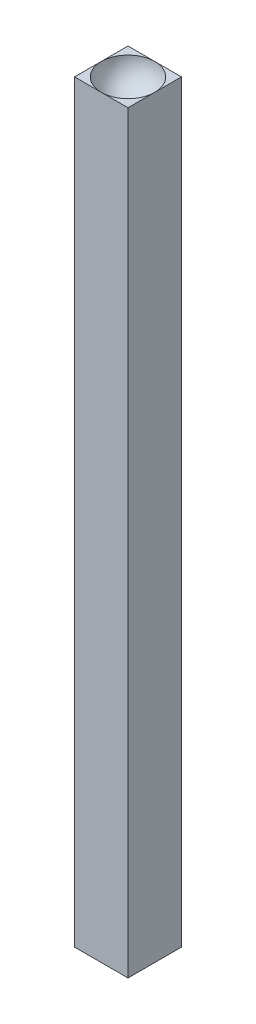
from build123d import *

# Parameters (mm, degrees)
SKETCH1_W           = 10
SKETCH1_H           = 10
BOSS_EXTRUDE1_DEPTH = 141


with BuildPart() as part:
    # Sketch1 → Boss-Extrude1 (new body)
    with BuildSketch(Plane(origin=(0, 0, 0), x_dir=(1, 0, 0), z_dir=(0, 1, 0))):
        with Locations((5, 5)):
            Rectangle(SKETCH1_W, SKETCH1_H)
    extrude(amount=BOSS_EXTRUDE1_DEPTH)

    # Sketch4 → Cut-Revolve1 (revolve, cut)
    with BuildSketch(Plane.XY.offset(-5)):
        with BuildLine():
            Line((5, 141), (5, 136))
            ThreePointArc((5, 136), (8.535533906, 137.464466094), (10, 141))
            Line((10, 141), (5, 141))
        make_face()
    revolve(axis=Axis((5, 141, -5), (0, -1, 0)), mode=Mode.SUBTRACT)


solid = part.part
